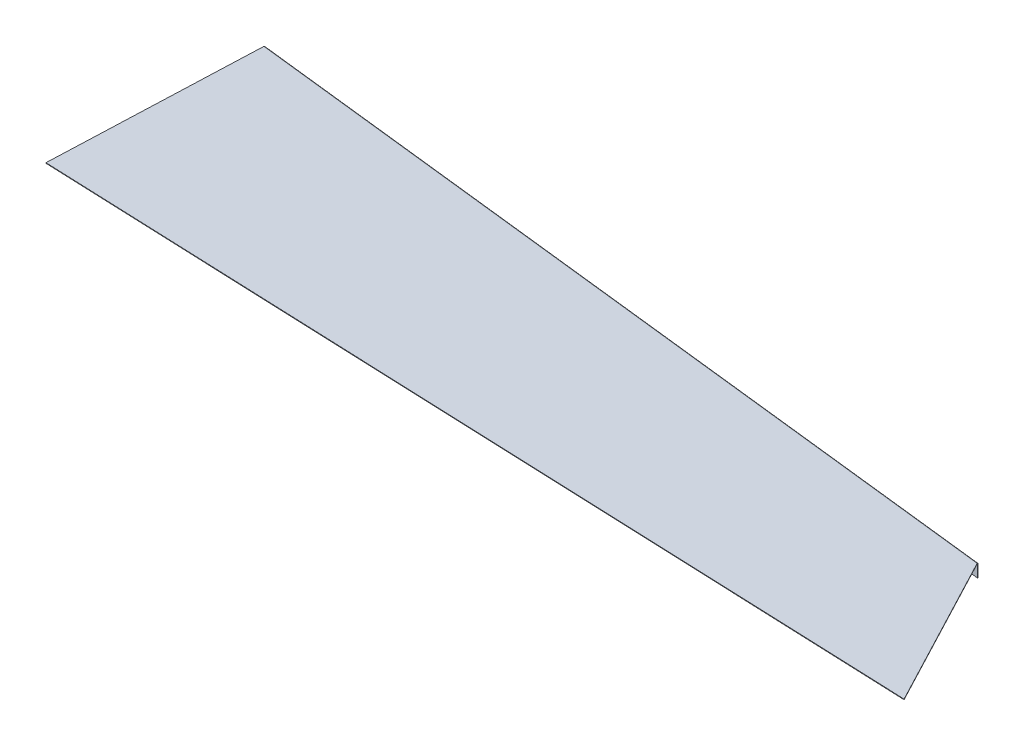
ISO-10303-21;
HEADER;
FILE_DESCRIPTION(('STEP AP214'),'2;1');
FILE_NAME('part.step','',(''),(''),'','','');
FILE_SCHEMA(('AUTOMOTIVE_DESIGN { 1 0 10303 214 1 1 1 1 }'));
ENDSEC;
DATA;
#1=APPLICATION_CONTEXT('core data for automotive mechanical design processes');
#2=APPLICATION_PROTOCOL_DEFINITION('international standard','automotive_design',2000,#1);
#3=PRODUCT_CONTEXT('',#1,'mechanical');
#4=PRODUCT('Part','Part','',(#3));
#5=PRODUCT_RELATED_PRODUCT_CATEGORY('part','',(#4));
#6=PRODUCT_DEFINITION_FORMATION('','',#4);
#7=PRODUCT_DEFINITION_CONTEXT('part definition',#1,'design');
#8=PRODUCT_DEFINITION('design','',#6,#7);
#9=PRODUCT_DEFINITION_SHAPE('','',#8);
#10=(LENGTH_UNIT() NAMED_UNIT(*) SI_UNIT(.MILLI.,.METRE.));
#11=(NAMED_UNIT(*) PLANE_ANGLE_UNIT() SI_UNIT($,.RADIAN.));
#12=(NAMED_UNIT(*) SI_UNIT($,.STERADIAN.) SOLID_ANGLE_UNIT());
#13=UNCERTAINTY_MEASURE_WITH_UNIT(LENGTH_MEASURE(1.E-05),#10,'distance_accuracy_value','');
#14=(GEOMETRIC_REPRESENTATION_CONTEXT(3) GLOBAL_UNCERTAINTY_ASSIGNED_CONTEXT((#13)) GLOBAL_UNIT_ASSIGNED_CONTEXT((#10,
#11,#12)) REPRESENTATION_CONTEXT('',''));
#15=CARTESIAN_POINT('',(0.,0.,0.));
#16=DIRECTION('',(0.,0.,1.));
#17=DIRECTION('',(1.,0.,0.));
#18=AXIS2_PLACEMENT_3D('',#15,#16,#17);
#19=CARTESIAN_POINT('',(-32.7070283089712,-38.1,-1173.06546193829));
#20=DIRECTION('',(0.99364664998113,0.00196799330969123,0.11252760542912));
#21=DIRECTION('',(0.00195549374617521,-0.999998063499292,0.00022145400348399));
#22=AXIS2_PLACEMENT_3D('',#19,#20,#21);
#23=PLANE('',#22);
#24=DIRECTION('',(-0.11252782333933,0.,0.993648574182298));
#25=VECTOR('',#24,1.);
#26=CARTESIAN_POINT('',(-32.7751750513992,-3.25119999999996,-1173.07317935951));
#27=LINE('',#26,#25);
#28=CARTESIAN_POINT('',(-32.5922498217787,-3.25119999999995,-1174.6884544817));
#29=VERTEX_POINT('',#28);
#30=CARTESIAN_POINT('',(-32.7751750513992,-3.25119999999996,-1173.07317935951));
#31=VERTEX_POINT('',#30);
#32=EDGE_CURVE('E12',#29,#31,#27,.T.);
#33=ORIENTED_EDGE('',*,*,#32,.F.);
#34=DIRECTION('',(0.00195549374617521,-0.999998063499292,0.00022145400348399));
#35=VECTOR('',#34,1.);
#36=CARTESIAN_POINT('',(-32.5241030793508,-38.1,-1174.68073706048));
#37=LINE('',#36,#35);
#38=CARTESIAN_POINT('',(-32.5241030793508,-38.1,-1174.68073706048));
#39=VERTEX_POINT('',#38);
#40=EDGE_CURVE('E231',#29,#39,#37,.T.);
#41=ORIENTED_EDGE('',*,*,#40,.T.);
#42=DIRECTION('',(-0.11252782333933,0.,0.993648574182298));
#43=VECTOR('',#42,1.);
#44=CARTESIAN_POINT('',(-32.7070283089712,-38.1,-1173.06546193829));
#45=LINE('',#44,#43);
#46=CARTESIAN_POINT('',(-32.7070283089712,-38.1,-1173.06546193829));
#47=VERTEX_POINT('',#46);
#48=EDGE_CURVE('E144',#39,#47,#45,.T.);
#49=ORIENTED_EDGE('',*,*,#48,.T.);
#50=DIRECTION('',(0.00195549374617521,-0.999998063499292,0.00022145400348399));
#51=VECTOR('',#50,1.);
#52=CARTESIAN_POINT('',(-32.7070283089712,-38.1,-1173.06546193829));
#53=LINE('',#52,#51);
#54=EDGE_CURVE('E266',#31,#47,#53,.T.);
#55=ORIENTED_EDGE('',*,*,#54,.F.);
#56=EDGE_LOOP('',(#33,#41,#49,#55));
#57=FACE_BOUND('',#56,.T.);
#58=ADVANCED_FACE('F131',(#57),#23,.F.);
#59=CARTESIAN_POINT('',(-32.7070283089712,-38.1,-1173.06546193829));
#60=DIRECTION('',(0.,1.,0.));
#61=DIRECTION('',(0.993648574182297,0.,0.11252782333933));
#62=AXIS2_PLACEMENT_3D('',#59,#60,#61);
#63=PLANE('',#62);
#64=ORIENTED_EDGE('',*,*,#48,.F.);
#65=DIRECTION('',(-0.993648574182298,0.,-0.11252782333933));
#66=VECTOR('',#65,1.);
#67=CARTESIAN_POINT('',(131.051556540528,-38.1,-1156.1562673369));
#68=LINE('',#67,#66);
#69=CARTESIAN_POINT('',(2312.50196986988,-38.1,-909.113325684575));
#70=VERTEX_POINT('',#69);
#71=EDGE_CURVE('E224',#39,#70,#68,.F.);
#72=ORIENTED_EDGE('',*,*,#71,.T.);
#73=DIRECTION('',(-0.11252782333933,0.,0.993648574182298));
#74=VECTOR('',#73,1.);
#75=CARTESIAN_POINT('',(2312.31904464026,-38.1,-907.498050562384));
#76=LINE('',#75,#74);
#77=CARTESIAN_POINT('',(2312.31904464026,-38.1,-907.498050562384));
#78=VERTEX_POINT('',#77);
#79=EDGE_CURVE('E257',#70,#78,#76,.T.);
#80=ORIENTED_EDGE('',*,*,#79,.T.);
#81=DIRECTION('',(0.993648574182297,0.,0.11252782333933));
#82=VECTOR('',#81,1.);
#83=CARTESIAN_POINT('',(-32.7070283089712,-38.1,-1173.06546193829));
#84=LINE('',#83,#82);
#85=EDGE_CURVE('E277',#47,#78,#84,.T.);
#86=ORIENTED_EDGE('',*,*,#85,.F.);
#87=EDGE_LOOP('',(#64,#72,#80,#86));
#88=FACE_BOUND('',#87,.T.);
#89=ADVANCED_FACE('F284',(#88),#63,.F.);
#90=CARTESIAN_POINT('',(2312.31904464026,-9.16182380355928E-13,-907.498050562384));
#91=DIRECTION('',(0.993648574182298,0.,0.11252782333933));
#92=DIRECTION('',(0.,-1.,0.));
#93=AXIS2_PLACEMENT_3D('',#90,#91,#92);
#94=PLANE('',#93);
#95=ORIENTED_EDGE('',*,*,#79,.F.);
#96=DIRECTION('',(0.,1.,0.));
#97=VECTOR('',#96,1.);
#98=CARTESIAN_POINT('',(2312.50196986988,3.25835269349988E-12,-909.113325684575));
#99=LINE('',#98,#97);
#100=CARTESIAN_POINT('',(2312.50196986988,-3.25119999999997,-909.113325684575));
#101=VERTEX_POINT('',#100);
#102=EDGE_CURVE('E239',#101,#70,#99,.F.);
#103=ORIENTED_EDGE('',*,*,#102,.F.);
#104=DIRECTION('',(-0.112527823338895,0.,0.993648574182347));
#105=VECTOR('',#104,1.);
#106=CARTESIAN_POINT('',(2312.31904464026,-3.25119999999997,-907.498050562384));
#107=LINE('',#106,#105);
#108=CARTESIAN_POINT('',(2312.31904464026,-3.25119999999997,-907.498050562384));
#109=VERTEX_POINT('',#108);
#110=EDGE_CURVE('E253',#101,#109,#107,.T.);
#111=ORIENTED_EDGE('',*,*,#110,.T.);
#112=DIRECTION('',(0.,-1.,0.));
#113=VECTOR('',#112,1.);
#114=CARTESIAN_POINT('',(2312.31904464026,-9.16182380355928E-13,-907.498050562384));
#115=LINE('',#114,#113);
#116=EDGE_CURVE('E282',#109,#78,#115,.T.);
#117=ORIENTED_EDGE('',*,*,#116,.T.);
#118=EDGE_LOOP('',(#95,#103,#111,#117));
#119=FACE_BOUND('',#118,.T.);
#120=ADVANCED_FACE('F318',(#119),#94,.T.);
#121=CARTESIAN_POINT('',(2313.9646074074,-3.25119999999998,-902.403722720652));
#122=CARTESIAN_POINT('',(2314.02558248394,-3.25119999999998,-902.942147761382));
#123=CARTESIAN_POINT('',(2314.08655756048,-3.25119999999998,-903.480572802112));
#124=CARTESIAN_POINT('',(2314.14753263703,-3.25119999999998,-904.018997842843));
#125=CARTESIAN_POINT('',(2313.9646074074,-9.75359999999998,-902.403722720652));
#126=CARTESIAN_POINT('',(2314.02558248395,-8.66986666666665,-902.942147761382));
#127=CARTESIAN_POINT('',(2314.08655756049,-7.58613333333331,-903.480572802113));
#128=CARTESIAN_POINT('',(2314.14753263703,-6.50239999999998,-904.018997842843));
#129=CARTESIAN_POINT('',(2312.50196986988,-9.75359999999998,-909.113325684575));
#130=CARTESIAN_POINT('',(2312.44099479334,-8.66986666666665,-908.574900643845));
#131=CARTESIAN_POINT('',(2312.3800197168,-7.58613333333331,-908.036475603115));
#132=CARTESIAN_POINT('',(2312.31904464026,-6.50239999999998,-907.498050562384));
#133=CARTESIAN_POINT('',(2312.50196986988,-3.25119999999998,-909.113325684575));
#134=CARTESIAN_POINT('',(2312.44099479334,-3.25119999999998,-908.574900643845));
#135=CARTESIAN_POINT('',(2312.3800197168,-3.25119999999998,-908.036475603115));
#136=CARTESIAN_POINT('',(2312.31904464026,-3.25119999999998,-907.498050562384));
#137=CARTESIAN_POINT('',(2312.50196986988,3.25120000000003,-909.113325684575));
#138=CARTESIAN_POINT('',(2312.44099479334,2.16746666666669,-908.574900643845));
#139=CARTESIAN_POINT('',(2312.3800197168,1.08373333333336,-908.036475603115));
#140=CARTESIAN_POINT('',(2312.31904464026,0.,-907.498050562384));
#141=CARTESIAN_POINT('',(2313.9646074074,3.25120000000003,-902.403722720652));
#142=CARTESIAN_POINT('',(2314.02558248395,2.16746666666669,-902.942147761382));
#143=CARTESIAN_POINT('',(2314.08655756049,1.08373333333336,-903.480572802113));
#144=CARTESIAN_POINT('',(2314.14753263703,0.,-904.018997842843));
#145=CARTESIAN_POINT('',(2313.9646074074,-3.25119999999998,-902.403722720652));
#146=CARTESIAN_POINT('',(2314.02558248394,-3.25119999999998,-902.942147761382));
#147=CARTESIAN_POINT('',(2314.08655756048,-3.25119999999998,-903.480572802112));
#148=CARTESIAN_POINT('',(2314.14753263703,-3.25119999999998,-904.018997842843));
#149=(BOUNDED_SURFACE() B_SPLINE_SURFACE(3,3,((#121,#122,#123,#124),(#125,#126,#127,#128),(#129,
#130,#131,#132),(#133,#134,#135,#136),(#137,#138,#139,#140),(#141,#142,#143,#144),(#145,#146,
#147,#148)),.UNSPECIFIED.,.T.,.F.,.F.) B_SPLINE_SURFACE_WITH_KNOTS((4,3,4),(4,4),(0.,0.5,1.),
(0.,1.),.UNSPECIFIED.) GEOMETRIC_REPRESENTATION_ITEM() RATIONAL_B_SPLINE_SURFACE(((1.,1.,1.,1.),
(0.333333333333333,0.333333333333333,0.333333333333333,0.333333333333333),(0.333333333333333,
0.333333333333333,0.333333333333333,0.333333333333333),(1.,1.,1.,1.),(0.333333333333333,
0.333333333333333,0.333333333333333,0.333333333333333),(0.333333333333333,0.333333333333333,
0.333333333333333,0.333333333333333),(1.,1.,1.,1.))) REPRESENTATION_ITEM('') SURFACE());
#150=CARTESIAN_POINT('',(2313.23328863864,-3.25119999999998,-905.758524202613));
#151=DIRECTION('',(-0.97705443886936,0.,0.212989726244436));
#152=DIRECTION('',(0.212989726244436,0.,0.97705443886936));
#153=AXIS2_PLACEMENT_3D('',#150,#151,#152);
#154=ELLIPSE('',#153,3.43358706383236,3.2512);
#155=CARTESIAN_POINT('',(2313.23328863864,0.,-905.758524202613));
#156=VERTEX_POINT('',#155);
#157=EDGE_CURVE('E219',#101,#156,#154,.F.);
#158=DIRECTION('',(0.,-1.,0.));
#159=VECTOR('',#158,1.);
#160=CARTESIAN_POINT('',(2313.23328863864,-1.62559999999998,-905.758524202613));
#161=LINE('',#160,#159);
#162=CARTESIAN_POINT('',(2313.23328863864,-1.62559999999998,-905.758524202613));
#163=VERTEX_POINT('',#162);
#164=EDGE_CURVE('E152',#156,#163,#161,.T.);
#165=CARTESIAN_POINT('',(2313.23328863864,-3.25119999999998,-905.758524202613));
#166=DIRECTION('',(-0.885189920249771,0.,0.465229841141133));
#167=DIRECTION('',(0.465229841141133,0.,0.885189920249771));
#168=AXIS2_PLACEMENT_3D('',#165,#166,#167);
#169=ELLIPSE('',#168,1.96514478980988,1.6256);
#170=EDGE_CURVE('E313',#109,#163,#169,.F.);
#171=ORIENTED_EDGE('',*,*,#110,.F.);
#172=ORIENTED_EDGE('',*,*,#157,.T.);
#173=ORIENTED_EDGE('',*,*,#164,.T.);
#174=ORIENTED_EDGE('',*,*,#170,.F.);
#175=EDGE_LOOP('',(#171,#172,#173,#174));
#176=FACE_BOUND('',#175,.T.);
#177=ADVANCED_FACE('F325',(#176),#149,.T.);
#178=CARTESIAN_POINT('',(2185.56638594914,-1.62559999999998,-1148.66954455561));
#179=DIRECTION('',(0.885189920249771,0.,-0.465229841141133));
#180=DIRECTION('',(-0.465229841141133,0.,-0.885189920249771));
#181=AXIS2_PLACEMENT_3D('',#178,#179,#180);
#182=PLANE('',#181);
#183=ORIENTED_EDGE('',*,*,#164,.F.);
#184=DIRECTION('',(-0.465229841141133,0.,-0.885189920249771));
#185=VECTOR('',#184,1.);
#186=CARTESIAN_POINT('',(2185.56638594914,0.,-1148.66954455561));
#187=LINE('',#186,#185);
#188=CARTESIAN_POINT('',(2549.28070732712,0.,-456.632571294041));
#189=VERTEX_POINT('',#188);
#190=EDGE_CURVE('E209',#189,#156,#187,.T.);
#191=ORIENTED_EDGE('',*,*,#190,.F.);
#192=DIRECTION('',(0.,-1.,0.));
#193=VECTOR('',#192,1.);
#194=CARTESIAN_POINT('',(2549.28070732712,-1.62559999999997,-456.632571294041));
#195=LINE('',#194,#193);
#196=CARTESIAN_POINT('',(2549.28070732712,-1.62559999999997,-456.632571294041));
#197=VERTEX_POINT('',#196);
#198=EDGE_CURVE('E247',#189,#197,#195,.T.);
#199=ORIENTED_EDGE('',*,*,#198,.T.);
#200=DIRECTION('',(-0.465229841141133,0.,-0.885189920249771));
#201=VECTOR('',#200,1.);
#202=CARTESIAN_POINT('',(2185.56638594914,-1.62559999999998,-1148.66954455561));
#203=LINE('',#202,#201);
#204=EDGE_CURVE('E289',#197,#163,#203,.T.);
#205=ORIENTED_EDGE('',*,*,#204,.T.);
#206=EDGE_LOOP('',(#183,#191,#199,#205));
#207=FACE_BOUND('',#206,.T.);
#208=ADVANCED_FACE('F331',(#207),#182,.T.);
#209=CARTESIAN_POINT('',(2549.28070732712,-1.62559999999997,-456.632571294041));
#210=DIRECTION('',(-0.0396940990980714,0.,0.999211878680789));
#211=DIRECTION('',(0.999211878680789,0.,0.0396940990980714));
#212=AXIS2_PLACEMENT_3D('',#209,#210,#211);
#213=PLANE('',#212);
#214=ORIENTED_EDGE('',*,*,#198,.F.);
#215=DIRECTION('',(0.999211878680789,0.,0.0396940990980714));
#216=VECTOR('',#215,1.);
#217=CARTESIAN_POINT('',(2549.28070732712,0.,-456.632571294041));
#218=LINE('',#217,#216);
#219=CARTESIAN_POINT('',(-56.8312245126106,0.,-560.161429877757));
#220=VERTEX_POINT('',#219);
#221=EDGE_CURVE('E228',#220,#189,#218,.T.);
#222=ORIENTED_EDGE('',*,*,#221,.F.);
#223=DIRECTION('',(0.,-1.,0.));
#224=VECTOR('',#223,1.);
#225=CARTESIAN_POINT('',(-56.8312245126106,-1.62559999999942,-560.161429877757));
#226=LINE('',#225,#224);
#227=CARTESIAN_POINT('',(-56.8312245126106,-1.62559999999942,-560.161429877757));
#228=VERTEX_POINT('',#227);
#229=EDGE_CURVE('E197',#220,#228,#226,.T.);
#230=ORIENTED_EDGE('',*,*,#229,.T.);
#231=DIRECTION('',(0.999211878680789,0.,0.0396940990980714));
#232=VECTOR('',#231,1.);
#233=CARTESIAN_POINT('',(2549.28070732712,-1.62559999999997,-456.632571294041));
#234=LINE('',#233,#232);
#235=EDGE_CURVE('E300',#228,#197,#234,.T.);
#236=ORIENTED_EDGE('',*,*,#235,.T.);
#237=EDGE_LOOP('',(#214,#222,#230,#236));
#238=FACE_BOUND('',#237,.T.);
#239=ADVANCED_FACE('F336',(#238),#213,.T.);
#240=CARTESIAN_POINT('',(-78.6927776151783,-1.62559999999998,-3.08818698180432));
#241=DIRECTION('',(-0.999230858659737,0.,-0.0392134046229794));
#242=DIRECTION('',(-0.0392134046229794,0.,0.999230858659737));
#243=AXIS2_PLACEMENT_3D('',#240,#241,#242);
#244=PLANE('',#243);
#245=ORIENTED_EDGE('',*,*,#229,.F.);
#246=DIRECTION('',(-0.0392134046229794,0.,0.999230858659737));
#247=VECTOR('',#246,1.);
#248=CARTESIAN_POINT('',(-78.6927776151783,0.,-3.08818698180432));
#249=LINE('',#248,#247);
#250=CARTESIAN_POINT('',(-32.8422719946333,0.,-1171.44478701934));
#251=VERTEX_POINT('',#250);
#252=EDGE_CURVE('E206',#251,#220,#249,.T.);
#253=ORIENTED_EDGE('',*,*,#252,.F.);
#254=DIRECTION('',(0.,-1.,0.));
#255=VECTOR('',#254,1.);
#256=CARTESIAN_POINT('',(-32.8422719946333,-1.62559999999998,-1171.44478701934));
#257=LINE('',#256,#255);
#258=CARTESIAN_POINT('',(-32.8422719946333,-1.62559999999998,-1171.44478701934));
#259=VERTEX_POINT('',#258);
#260=EDGE_CURVE('E137',#251,#259,#257,.T.);
#261=ORIENTED_EDGE('',*,*,#260,.T.);
#262=DIRECTION('',(-0.0392134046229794,0.,0.999230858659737));
#263=VECTOR('',#262,1.);
#264=CARTESIAN_POINT('',(-78.6927776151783,-1.62559999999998,-3.08818698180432));
#265=LINE('',#264,#263);
#266=EDGE_CURVE('E286',#259,#228,#265,.T.);
#267=ORIENTED_EDGE('',*,*,#266,.T.);
#268=EDGE_LOOP('',(#245,#253,#261,#267));
#269=FACE_BOUND('',#268,.T.);
#270=ADVANCED_FACE('F221',(#269),#244,.T.);
#271=CARTESIAN_POINT('',(-32.9029035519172,-3.29460669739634,-1169.81624582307));
#272=CARTESIAN_POINT('',(-32.9638568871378,-3.30907559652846,-1169.27801276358));
#273=CARTESIAN_POINT('',(-33.0248102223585,-3.32354449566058,-1168.73977970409));
#274=CARTESIAN_POINT('',(-33.0857635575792,-3.3380133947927,-1168.2015466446));
#275=CARTESIAN_POINT('',(-32.9126724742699,-0.0445659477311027,-1169.72998381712));
#276=CARTESIAN_POINT('',(-32.9768821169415,1.02431206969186,-1169.16299675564));
#277=CARTESIAN_POINT('',(-33.0410917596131,2.09319008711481,-1168.59600969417));
#278=CARTESIAN_POINT('',(-33.1053014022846,3.16206810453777,-1168.02902263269));
#279=CARTESIAN_POINT('',(-32.7850516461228,0.0422474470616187,-1172.986346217));
#280=CARTESIAN_POINT('',(-32.7273546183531,1.14006326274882,-1173.4958252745));
#281=CARTESIAN_POINT('',(-32.6696575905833,2.23787907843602,-1174.00530433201));
#282=CARTESIAN_POINT('',(-32.6119605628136,3.33569489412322,-1174.51478338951));
#283=CARTESIAN_POINT('',(-32.7752827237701,-3.20779330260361,-1173.07260822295));
#284=CARTESIAN_POINT('',(-32.7143293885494,-3.19332440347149,-1173.61084128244));
#285=CARTESIAN_POINT('',(-32.6533760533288,-3.17885550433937,-1174.14907434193));
#286=CARTESIAN_POINT('',(-32.5924227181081,-3.16438660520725,-1174.68730740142));
#287=CARTESIAN_POINT('',(-32.7655138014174,-6.45783405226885,-1173.15887022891));
#288=CARTESIAN_POINT('',(-32.7013041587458,-7.52671206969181,-1173.72585729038));
#289=CARTESIAN_POINT('',(-32.6370945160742,-8.59559008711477,-1174.29284435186));
#290=CARTESIAN_POINT('',(-32.5728848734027,-9.66446810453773,-1174.85983141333));
#291=CARTESIAN_POINT('',(-32.8931346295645,-6.54464744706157,-1169.90250782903));
#292=CARTESIAN_POINT('',(-32.9508316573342,-7.64246326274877,-1169.39302877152));
#293=CARTESIAN_POINT('',(-33.008528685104,-8.74027907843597,-1168.88354971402));
#294=CARTESIAN_POINT('',(-33.0662257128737,-9.83809489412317,-1168.37407065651));
#295=CARTESIAN_POINT('',(-32.9029035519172,-3.29460669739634,-1169.81624582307));
#296=CARTESIAN_POINT('',(-32.9638568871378,-3.30907559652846,-1169.27801276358));
#297=CARTESIAN_POINT('',(-33.0248102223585,-3.32354449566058,-1168.73977970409));
#298=CARTESIAN_POINT('',(-33.0857635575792,-3.3380133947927,-1168.2015466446));
#299=(BOUNDED_SURFACE() B_SPLINE_SURFACE(3,3,((#271,#272,#273,#274),(#275,#276,#277,#278),(#279,
#280,#281,#282),(#283,#284,#285,#286),(#287,#288,#289,#290),(#291,#292,#293,#294),(#295,#296,
#297,#298)),.UNSPECIFIED.,.T.,.F.,.F.) B_SPLINE_SURFACE_WITH_KNOTS((4,3,4),(4,4),(0.,0.5,1.),
(0.,1.),.UNSPECIFIED.) GEOMETRIC_REPRESENTATION_ITEM() RATIONAL_B_SPLINE_SURFACE(((1.,1.,1.,1.),
(0.333333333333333,0.333333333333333,0.333333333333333,0.333333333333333),(0.333333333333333,
0.333333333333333,0.333333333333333,0.333333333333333),(1.,1.,1.,1.),(0.333333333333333,
0.333333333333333,0.333333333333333,0.333333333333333),(0.333333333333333,0.333333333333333,
0.333333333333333,0.333333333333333),(1.,1.,1.,1.))) REPRESENTATION_ITEM('') SURFACE());
#300=CARTESIAN_POINT('',(-32.8390931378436,-3.25119999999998,-1171.44442702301));
#301=DIRECTION('',(-0.997117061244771,-0.000983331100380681,-0.0758722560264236));
#302=DIRECTION('',(-0.0758191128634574,-0.0266838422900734,0.996764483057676));
#303=AXIS2_PLACEMENT_3D('',#300,#301,#302);
#304=ELLIPSE('',#303,3.25340683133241,3.2512);
#305=EDGE_CURVE('E188',#251,#29,#304,.T.);
#306=CARTESIAN_POINT('',(-32.8390931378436,-3.25119999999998,-1171.44442702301));
#307=DIRECTION('',(-0.999228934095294,-0.00196267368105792,-0.0392133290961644));
#308=DIRECTION('',(-0.039147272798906,-0.0266297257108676,0.998878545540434));
#309=AXIS2_PLACEMENT_3D('',#306,#307,#308);
#310=ELLIPSE('',#309,1.63000918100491,1.6256);
#311=EDGE_CURVE('E190',#259,#31,#310,.T.);
#312=ORIENTED_EDGE('',*,*,#305,.T.);
#313=ORIENTED_EDGE('',*,*,#32,.T.);
#314=ORIENTED_EDGE('',*,*,#311,.F.);
#315=ORIENTED_EDGE('',*,*,#260,.F.);
#316=EDGE_LOOP('',(#312,#313,#314,#315));
#317=FACE_BOUND('',#316,.T.);
#318=ADVANCED_FACE('F133',(#317),#299,.F.);
#319=CARTESIAN_POINT('',(0.,-1.62559999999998,0.));
#320=DIRECTION('',(0.,1.,0.));
#321=DIRECTION('',(0.,0.,1.));
#322=AXIS2_PLACEMENT_3D('',#319,#320,#321);
#323=PLANE('',#322);
#324=ORIENTED_EDGE('',*,*,#266,.F.);
#325=DIRECTION('',(-0.993648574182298,0.,-0.11252782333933));
#326=VECTOR('',#325,1.);
#327=CARTESIAN_POINT('',(2312.13611941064,-1.62559999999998,-905.882775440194));
#328=LINE('',#327,#326);
#329=EDGE_CURVE('E198',#259,#163,#328,.F.);
#330=ORIENTED_EDGE('',*,*,#329,.T.);
#331=ORIENTED_EDGE('',*,*,#204,.F.);
#332=ORIENTED_EDGE('',*,*,#235,.F.);
#333=EDGE_LOOP('',(#324,#330,#331,#332));
#334=FACE_BOUND('',#333,.T.);
#335=ADVANCED_FACE('F335',(#334),#323,.F.);
#336=CARTESIAN_POINT('',(130.868631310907,3.25380690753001E-12,-1154.54099221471));
#337=DIRECTION('',(0.11252782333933,0.,-0.993648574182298));
#338=DIRECTION('',(-0.993648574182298,0.,-0.11252782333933));
#339=AXIS2_PLACEMENT_3D('',#336,#337,#338);
#340=PLANE('',#339);
#341=ORIENTED_EDGE('',*,*,#116,.F.);
#342=DIRECTION('',(-0.993648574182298,0.,-0.11252782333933));
#343=VECTOR('',#342,1.);
#344=CARTESIAN_POINT('',(-32.7783539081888,-3.25119999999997,-1173.07353935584));
#345=LINE('',#344,#343);
#346=EDGE_CURVE('E280',#109,#31,#345,.T.);
#347=ORIENTED_EDGE('',*,*,#346,.T.);
#348=ORIENTED_EDGE('',*,*,#54,.T.);
#349=ORIENTED_EDGE('',*,*,#85,.T.);
#350=EDGE_LOOP('',(#341,#347,#348,#349));
#351=FACE_BOUND('',#350,.T.);
#352=ADVANCED_FACE('F276',(#351),#340,.F.);
#353=CARTESIAN_POINT('',(130.685706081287,-3.25119999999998,-1152.92571709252));
#354=DIRECTION('',(0.993648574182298,0.,0.11252782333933));
#355=DIRECTION('',(0.11252782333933,0.,-0.993648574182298));
#356=AXIS2_PLACEMENT_3D('',#353,#354,#355);
#357=CYLINDRICAL_SURFACE('',#356,1.6256);
#358=ORIENTED_EDGE('',*,*,#170,.T.);
#359=ORIENTED_EDGE('',*,*,#329,.F.);
#360=ORIENTED_EDGE('',*,*,#311,.T.);
#361=ORIENTED_EDGE('',*,*,#346,.F.);
#362=EDGE_LOOP('',(#358,#359,#360,#361));
#363=FACE_BOUND('',#362,.T.);
#364=ADVANCED_FACE('F326',(#363),#357,.F.);
#365=CARTESIAN_POINT('',(0.,0.,0.));
#366=DIRECTION('',(0.,1.,0.));
#367=DIRECTION('',(0.,0.,1.));
#368=AXIS2_PLACEMENT_3D('',#365,#366,#367);
#369=PLANE('',#368);
#370=ORIENTED_EDGE('',*,*,#252,.T.);
#371=ORIENTED_EDGE('',*,*,#221,.T.);
#372=ORIENTED_EDGE('',*,*,#190,.T.);
#373=DIRECTION('',(0.993648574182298,0.,0.11252782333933));
#374=VECTOR('',#373,1.);
#375=CARTESIAN_POINT('',(130.685706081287,0.,-1152.92571709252));
#376=LINE('',#375,#374);
#377=EDGE_CURVE('E203',#251,#156,#376,.T.);
#378=ORIENTED_EDGE('',*,*,#377,.F.);
#379=EDGE_LOOP('',(#370,#371,#372,#378));
#380=FACE_BOUND('',#379,.T.);
#381=ADVANCED_FACE('F204',(#380),#369,.T.);
#382=CARTESIAN_POINT('',(131.051556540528,3.25835269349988E-12,-1156.1562673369));
#383=DIRECTION('',(0.11252782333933,0.,-0.993648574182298));
#384=DIRECTION('',(-0.993648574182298,0.,-0.11252782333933));
#385=AXIS2_PLACEMENT_3D('',#382,#383,#384);
#386=PLANE('',#385);
#387=ORIENTED_EDGE('',*,*,#102,.T.);
#388=ORIENTED_EDGE('',*,*,#71,.F.);
#389=ORIENTED_EDGE('',*,*,#40,.F.);
#390=DIRECTION('',(-0.993648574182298,0.,-0.11252782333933));
#391=VECTOR('',#390,1.);
#392=CARTESIAN_POINT('',(131.051556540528,-3.25119999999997,-1156.1562673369));
#393=LINE('',#392,#391);
#394=EDGE_CURVE('E213',#101,#29,#393,.T.);
#395=ORIENTED_EDGE('',*,*,#394,.F.);
#396=EDGE_LOOP('',(#387,#388,#389,#395));
#397=FACE_BOUND('',#396,.T.);
#398=ADVANCED_FACE('F433',(#397),#386,.T.);
#399=CARTESIAN_POINT('',(130.685706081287,-3.25119999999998,-1152.92571709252));
#400=DIRECTION('',(0.993648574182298,0.,0.11252782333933));
#401=DIRECTION('',(0.11252782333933,0.,-0.993648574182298));
#402=AXIS2_PLACEMENT_3D('',#399,#400,#401);
#403=CYLINDRICAL_SURFACE('',#402,3.2512);
#404=ORIENTED_EDGE('',*,*,#157,.F.);
#405=ORIENTED_EDGE('',*,*,#394,.T.);
#406=ORIENTED_EDGE('',*,*,#305,.F.);
#407=ORIENTED_EDGE('',*,*,#377,.T.);
#408=EDGE_LOOP('',(#404,#405,#406,#407));
#409=FACE_BOUND('',#408,.T.);
#410=ADVANCED_FACE('F215',(#409),#403,.T.);
#411=CLOSED_SHELL('',(#58,#89,#120,#177,#208,#239,#270,#318,#335,#352,#364,#381,#398,#410));
#412=MANIFOLD_SOLID_BREP('B2',#411);
#413=ADVANCED_BREP_SHAPE_REPRESENTATION('',(#18,#412),#14);
#414=SHAPE_DEFINITION_REPRESENTATION(#9,#413);
ENDSEC;
END-ISO-10303-21;
